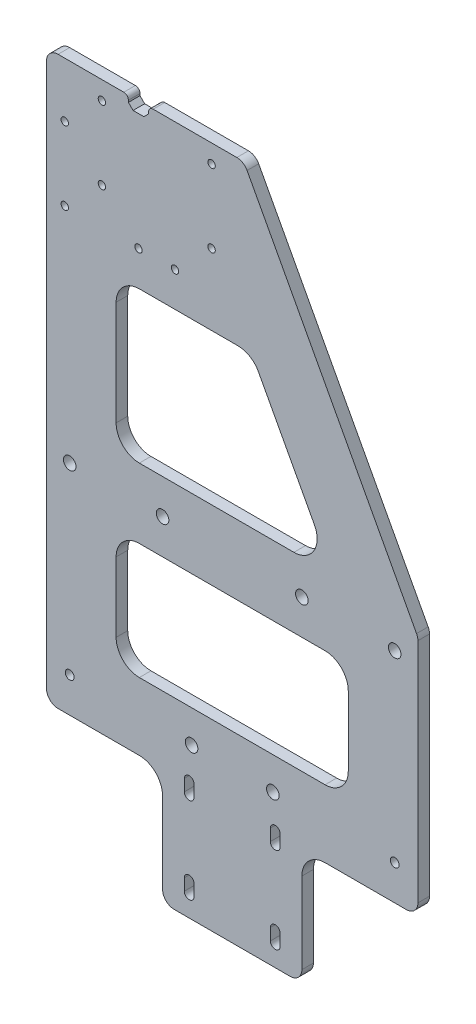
from build123d import *

# Parameters (mm, degrees)
SKETCH2_W              = 203.2
SKETCH2_H              = 203.2
SKETCH2_R              = 3.429
SKETCH2_R_2            = 2.413
BOSS_EXTRUDE1_DEPTH    = 6.35
CUT_EXTRUDE1_DEPTH     = 288.438345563
CUT_EXTRUDE3_DEPTH     = 288.438345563
FILLET1_R              = 12.7
FILLET2_R              = 6.35
BOSS_EXTRUDE2_DEPTH    = 6.35
FILLET3_R              = 6.35
F_10_32_TAPPED_HOLE1_D = 4.0386
SKETCH12_W             = 127
SKETCH12_H             = 63.5
CUT_EXTRUDE4_DEPTH     = 283.102993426
FILLET4_R              = 12.7
SKETCH13_W             = 10.998679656
SKETCH13_H             = 4.299339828
SKETCH13_H_2           = 1.8
CUT_EXTRUDE5_DEPTH     = 283.102993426
FILLET6_R              = 2.54
CHAMFER1_SIZE          = 2.54


with BuildPart() as part:
    # Sketch2 → Boss-Extrude1 (new body)
    with BuildSketch(Plane.XY):
        with Locations((101.6, -101.6)):
            Rectangle(SKETCH2_W, SKETCH2_H)
        with Locations((63.5, -12.7)):
            Circle(SKETCH2_R, mode=Mode.SUBTRACT)
        with Locations((79.375, -113.03)):
            Circle(SKETCH2_R, mode=Mode.SUBTRACT)
        with Locations(Location((190.5, -12.7, 0), (0, 0, 180))):
            Circle(SKETCH2_R, mode=Mode.SUBTRACT)
        with Locations(Location((190.5, -113.03, 0), (0, 0, 180))):
            Circle(SKETCH2_R_2, mode=Mode.SUBTRACT)
        with Locations(Location((123.825, -113.03, 0), (0, 0, 180))):
            Circle(SKETCH2_R, mode=Mode.SUBTRACT)
        with Locations((12.7, -12.7)):
            Circle(SKETCH2_R, mode=Mode.SUBTRACT)
        with Locations(Location((139.7, -12.7, 0), (0, 0, 180))):
            Circle(SKETCH2_R, mode=Mode.SUBTRACT)
        with Locations((12.7, -113.03)):
            Circle(SKETCH2_R_2, mode=Mode.SUBTRACT)
    extrude(amount=BOSS_EXTRUDE1_DEPTH)

    # Sketch5 → Cut-Extrude1 (cut, through all)
    with BuildSketch(Plane.XY.offset(6.35)):
        with BuildLine():
            Line((80.7212, -130.7592), (80.7212, -137.1092))
            ThreePointArc((80.7212, -137.1092), (78.0542, -139.7762), (75.3872, -137.1092))
            Line((75.3872, -137.1092), (75.3872, -130.7592))
            ThreePointArc((75.3872, -130.7592), (78.0542, -128.0922), (80.7212, -130.7592))
        make_face()
        with BuildLine():
            Line((80.7212, -177.8508), (80.7212, -184.2008))
            ThreePointArc((80.7212, -184.2008), (78.0542, -186.8678), (75.3872, -184.2008))
            Line((75.3872, -184.2008), (75.3872, -177.8508))
            ThreePointArc((75.3872, -177.8508), (78.0542, -175.1838), (80.7212, -177.8508))
        make_face()
        with BuildLine():
            Line((127.8128, -130.7592), (127.8128, -137.1092))
            ThreePointArc((127.8128, -137.1092), (125.1458, -139.7762), (122.4788, -137.1092))
            Line((122.4788, -137.1092), (122.4788, -130.7592))
            ThreePointArc((122.4788, -130.7592), (125.1458, -128.0922), (127.8128, -130.7592))
        make_face()
        with BuildLine():
            Line((127.8128, -177.8508), (127.8128, -184.2008))
            ThreePointArc((127.8128, -184.2008), (125.1458, -186.8678), (122.4788, -184.2008))
            Line((122.4788, -184.2008), (122.4788, -177.8508))
            ThreePointArc((122.4788, -177.8508), (125.1458, -175.1838), (127.8128, -177.8508))
        make_face()
    extrude(amount=-CUT_EXTRUDE1_DEPTH, mode=Mode.SUBTRACT)

    # Sketch7 → Cut-Extrude3 (cut, through all)
    with BuildSketch(Plane.XY.offset(6.35)):
        Polygon((0, -132.169783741), (63.5, -132.169783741), (63.5, -195.58), (139.7, -195.58), (139.7, -132.169783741), (203.2, -132.169783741), (203.2, -203.2), (104.775, -203.2), (47.625, -203.2), (0, -203.2), align=None)
    extrude(amount=-CUT_EXTRUDE3_DEPTH, mode=Mode.SUBTRACT)

    # Fillet1
    fillet1_edges = [part.edges().sort_by_distance(p)[0] for p in [
        (63.5, -132.169783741, 3.175),
        (139.7, -132.169783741, 3.175),
    ]]
    fillet(fillet1_edges, radius=FILLET1_R)

    # Fillet2
    fillet2_edges = [part.edges().sort_by_distance(p)[0] for p in [
        (0, -132.169783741, 3.175),
        (63.5, -195.58, 3.175),
        (139.7, -195.58, 3.175),
        (203.2, -132.169783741, 3.175),
    ]]
    fillet(fillet2_edges, radius=FILLET2_R)

    # Sketch8 → Boss-Extrude2 (add)
    with BuildSketch(Plane(origin=(0, 0, 0), x_dir=(-1, 0, 0), z_dir=(0, 0, -1))):
        Polygon((0, 0), (0, 177.8), (-107.95, 177.8), (-203.2, 0), align=None)
    extrude(amount=-BOSS_EXTRUDE2_DEPTH)

    # Fillet3
    fillet3_edges = [part.edges().sort_by_distance(p)[0] for p in [
        (107.95, 177.8, 3.175),
        (0, 177.8, 3.175),
        (203.2, 0, 3.175),
    ]]
    fillet(fillet3_edges, radius=FILLET3_R)

    # 10-32 Tapped Hole1 (through all)
    with Locations(Plane.XY.offset(6.35)):
        with Locations((30.325, 167.8), (10, 147.8), (10, 107.8), (30.325, 127.8), (90.325, 127.8), (90.325, 167.8), (50.325, 107.8), (70.325, 107.8)):
            Hole(F_10_32_TAPPED_HOLE1_D / 2)

    # Sketch12 → Cut-Extrude4 (cut, through all)
    with BuildSketch(Plane.XY.offset(6.35)):
        Polygon((38.1, 88.9), (112.352236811, 88.9), (156.575451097, 6.35), (38.1, 6.35), align=None)
        with Locations((101.6, -63.5)):
            Rectangle(SKETCH12_W, SKETCH12_H)
    extrude(amount=-CUT_EXTRUDE4_DEPTH, mode=Mode.SUBTRACT)

    # Fillet4
    fillet4_edges = [part.edges().sort_by_distance(p)[0] for p in [
        (38.1, 6.35, 3.175),
        (38.1, 88.9, 3.175),
        (112.352236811, 88.9, 3.175),
        (156.575451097, 6.35, 3.175),
        (38.1, -95.25, 3.175),
        (38.1, -31.75, 3.175),
        (165.1, -31.75, 3.175),
        (165.1, -95.25, 3.175),
    ]]
    fillet(fillet4_edges, radius=FILLET4_R)

    # Sketch13 → Cut-Extrude5 (cut, through all)
    with BuildSketch(Plane.XY.offset(6.35)):
        with Locations((50.325, 173.850330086)):
            Rectangle(SKETCH13_W, SKETCH13_H)
        with Locations((50.325, 176.9)):
            Rectangle(SKETCH13_W, SKETCH13_H_2)
    extrude(amount=-CUT_EXTRUDE5_DEPTH, mode=Mode.SUBTRACT)

    # Fillet6
    fillet6_edges = [part.edges().sort_by_distance(p)[0] for p in [
        (55.824339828, 177.8, 3.175),
        (44.825660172, 177.8, 3.175),
    ]]
    fillet(fillet6_edges, radius=FILLET6_R)

    # Chamfer1
    chamfer1_edges = [part.edges().sort_by_distance(p)[0] for p in [
        (55.824339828, 171.700660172, 3.175),
        (44.825660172, 171.700660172, 3.175),
    ]]
    chamfer(chamfer1_edges, length=CHAMFER1_SIZE)


solid = part.part
